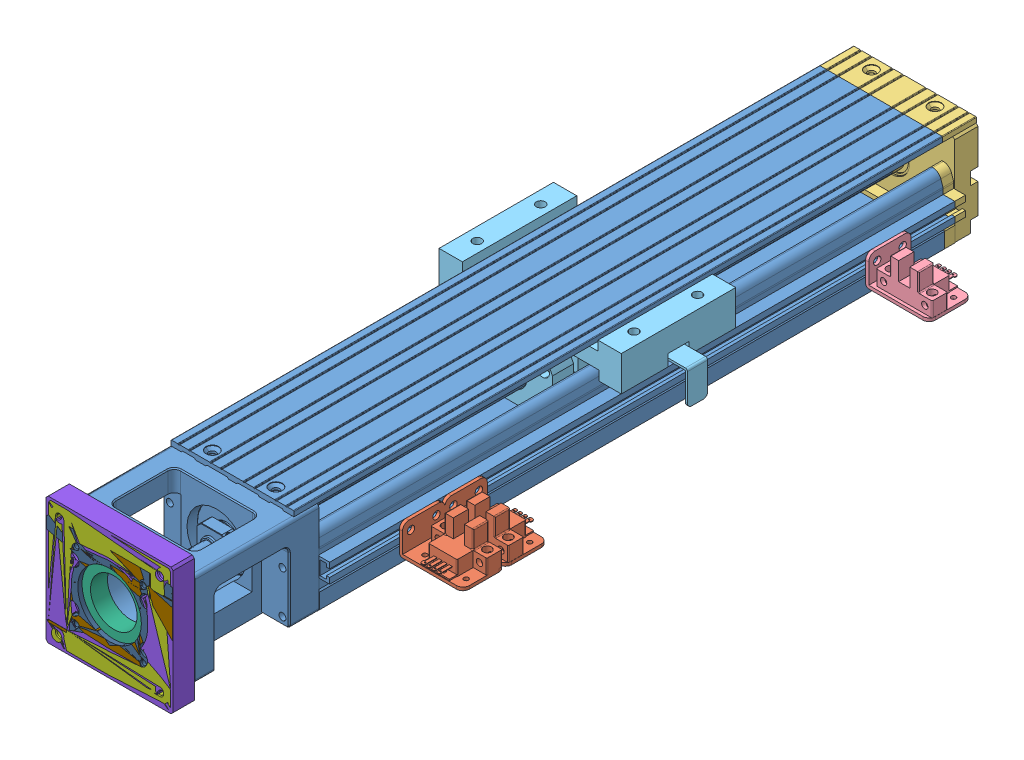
SolidWorks assembly FF60-B-0.SLDASM, configuration 300 (file format 9000). Lengths in mm.
Overall size (107.85 60 380).
12 component instances, 10 part files, 22 mates.
Components (placement in the parent):
- FF60-B-1-1: FF60-B-1.sldasm [300] at origin size (99.7 47 354)
  - FF60-B-4-1: FF60-B-4.sldprt [300] at origin size (69.7 47 354)
  - FF60-B-3-1: FF60-B-3.sldprt [默认] at (0 0 -10)
- FF60-B-2-1: FF60-B-2.sldasm [默认] at (0 0 -100) size (99.7 47 58.1)
  - FF60-B-5-1: FF60-B-5.sldprt [默认] at origin size (69.7 47 16)
  - FF60-B-6-1: FF60-B-6.sldprt [默认] at origin size (30 17.1 22.3)
- FF60-B-7-1: FF60-B-7.sldprt [默认] at (0 0 1.5288)
- 电机法兰（42步进电机）-1: 电机法兰（42步进电机）.SLDPRT [默认] at (0 23.5 159) x (1 0 0) z (0 -1 0)
- 电机法兰（57步进电机）-1: 电机法兰（57步进电机）.SLDPRT [默认] at (0 23 159) x (1 0 0) z (0 -1 0)
- 电机法兰（60步进电机）-1: 电机法兰（60步进电机）.SLDPRT [默认] at (0 23 159) x (1 0 0) z (0 -1 0)
- 电机法兰（三菱）（30W-50W-100W）-1: 电机法兰（三菱）（30W-50W-100W）.SLDPRT [默认] at (0 23.5 159) x (1 0 0) z (0 -1 0)
- 电机法兰（松下）（30W-50W-100W）-1: 电机法兰（松下）（30W-50W-100W）.SLDPRT [默认] at (0 23.5 159) x (1 0 0) z (0 -1 0)
Mates (geometry in assembly coordinates):
- 距离1: distance = 13.2 mm aligned: plane of FF60-B-1-1/FF60-B-4-1 through (29.8 1.18 159.67) normal (1 0 0); plane of FF60-B-7-1 through (43 31.17 -28.3912) normal (1 0 0)
- 距离2: distance = 3.5 mm aligned: plane of FF60-B-1-1/FF60-B-4-1 through (29.432 44.5 98.83) normal (0 1 0); plane of FF60-B-7-1 through (31.78 48 -84.5512) normal (0 1 0)
- 重合1: coincident aligned: plane of FF60-B-1-1/FF60-B-4-1 through (29.8 1.18 159.67) normal (1 0 0); plane of FF60-B-2-1/FF60-B-5-1 through (29.8 0.66 -211.22) normal (1 0 0)
- 重合2: coincident aligned: plane of FF60-B-1-1/FF60-B-4-1 through (9.2 0 100.2) normal (0 -1 0); plane of FF60-B-2-1/FF60-B-5-1 through (9.2 0 -194.8505) normal (0 -1 0)
- 重合3: coincident anti-aligned: plane of FF60-B-1-1/FF60-B-4-1 through (-27.35 25.6754 -195) normal (0 0 -1); plane of FF60-B-2-1/FF60-B-5-1 through (36.244 32.64 -195) normal (0 0 1)
- LimitDistance1: limit distance = 112.4712 mm anti-aligned: plane of FF60-B-7-1 through (-19.24 36 -21.4712) normal (0 0 1); plane of FF60-B-1-1/FF60-B-4-1 through (-17.16 40.16 91) normal (0 0 -1)
- LimitDistance2: limit distance = 106.5288 mm anti-aligned: plane of FF60-B-7-1 through (-21.32 36.012 -93.4712) normal (0 0 -1); plane of FF60-B-2-1/FF60-B-5-1 through (-30.992 6.148 -200) normal (0 0 1)
- 重合4: coincident anti-aligned: plane of FF60-B-1-1/FF60-B-4-1 through (30.472 0.14 159) normal (0 0 1); plane of 电机法兰（42步进电机）-1 through (-30.992 0.62 159) normal (0 0 -1)
- 同心1: concentric aligned: cylinder of FF60-B-1-1/FF60-B-4-1 through (-17.3205 33 149) axis (0 0 1) radius 1.1; cylinder of 电机法兰（42步进电机）-1 through (-17.3205 33 159) axis (0 0 1) radius 1.75
- 同心2: concentric aligned: cylinder of FF60-B-1-1/FF60-B-4-1 through (17.3205 33 149) axis (0 0 1) radius 1.1; cylinder of 电机法兰（42步进电机）-1 through (17.3205 33 159) axis (0 0 1) radius 1.75
- 重合5: coincident anti-aligned: plane of FF60-B-1-1/FF60-B-4-1 through (30.472 0.14 159) normal (0 0 1); plane of 电机法兰（57步进电机）-1 through (-30.004 -7.004 159) normal (0 0 -1)
- 同心4: concentric aligned: cylinder of FF60-B-1-1/FF60-B-4-1 through (-14.1421 37.1421 149) axis (0 0 1) radius 1.6; cylinder of 电机法兰（57步进电机）-1 through (-14.1421 37.1421 159) axis (0 0 1) radius 2.25
- 同心5: concentric aligned: cylinder of FF60-B-1-1/FF60-B-4-1 through (14.1421 37.1421 149) axis (0 0 1) radius 1.6; cylinder of 电机法兰（57步进电机）-1 through (14.1421 37.1421 159) axis (0 0 1) radius 2.25
- 重合6: coincident anti-aligned: plane of FF60-B-1-1/FF60-B-4-1 through (30.472 0.14 159) normal (0 0 1); plane of 电机法兰（60步进电机）-1 through (-31.2 -8.2 159) normal (0 0 -1)
- 同心6: concentric aligned: cylinder of FF60-B-1-1/FF60-B-4-1 through (-14.1421 37.1421 149) axis (0 0 1) radius 1.6; cylinder of 电机法兰（60步进电机）-1 through (-14.1421 37.1421 159) axis (0 0 1) radius 2.25
- 同心7: concentric aligned: cylinder of FF60-B-1-1/FF60-B-4-1 through (14.1421 37.1421 149) axis (0 0 1) radius 1.6; cylinder of 电机法兰（60步进电机）-1 through (14.1421 37.1421 159) axis (0 0 1) radius 2.25
- 重合7: coincident anti-aligned: plane of FF60-B-1-1/FF60-B-4-1 through (30.472 0.14 159) normal (0 0 1); plane of 电机法兰（三菱）（30W-50W-100W）-1 through (-30.992 0.62 159) normal (0 0 -1)
- 同心8: concentric aligned: cylinder of FF60-B-1-1/FF60-B-4-1 through (-17.3205 33 149) axis (0 0 1) radius 1.1; cylinder of 电机法兰（三菱）（30W-50W-100W）-1 through (-17.3205 33 159) axis (0 0 1) radius 1.75
- 同心9: concentric aligned: cylinder of FF60-B-1-1/FF60-B-4-1 through (17.3205 33 149) axis (0 0 1) radius 1.1; cylinder of 电机法兰（三菱）（30W-50W-100W）-1 through (17.3205 33 159) axis (0 0 1) radius 1.75
- 重合8: coincident anti-aligned: plane of FF60-B-1-1/FF60-B-4-1 through (30.472 0.14 159) normal (0 0 1); plane of 电机法兰（松下）（30W-50W-100W）-1 through (-30.992 0.62 159) normal (0 0 -1)
- 同心10: concentric aligned: cylinder of FF60-B-1-1/FF60-B-4-1 through (-17.3205 33 149) axis (0 0 1) radius 1.1; cylinder of 电机法兰（松下）（30W-50W-100W）-1 through (-17.3205 33 159) axis (0 0 1) radius 1.75
- 同心11: concentric aligned: cylinder of FF60-B-1-1/FF60-B-4-1 through (17.3205 33 149) axis (0 0 1) radius 1.1; cylinder of 电机法兰（松下）（30W-50W-100W）-1 through (17.3205 33 159) axis (0 0 1) radius 1.75
